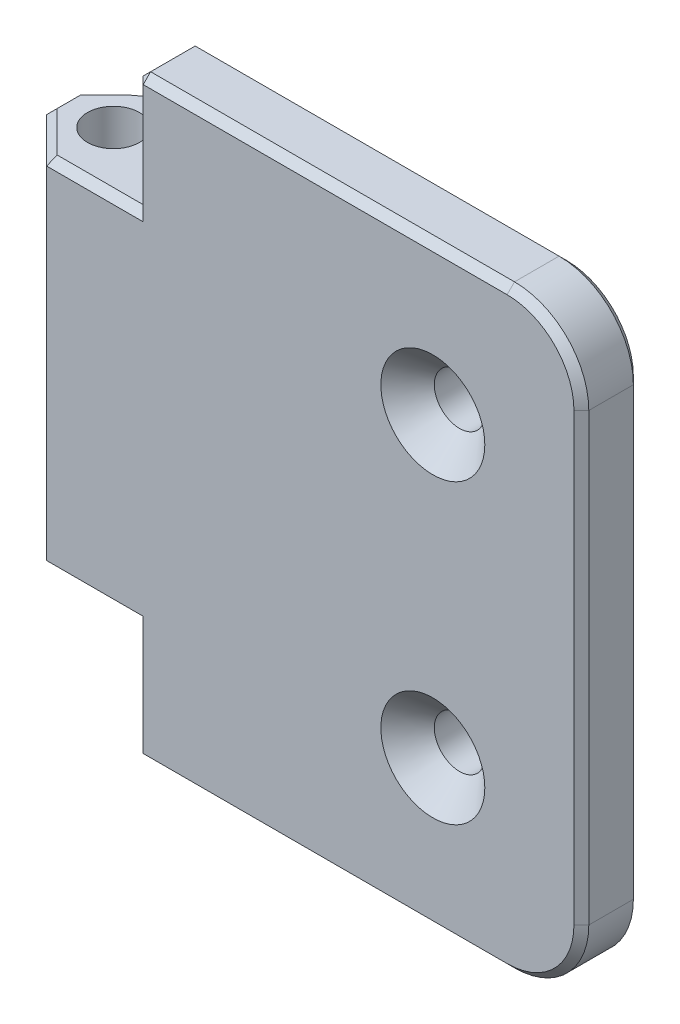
from build123d import *

# Parameters (mm, degrees)
SKIZZE1_W                                            = 39
SKIZZE1_H                                            = 40
AUFSATZ_LINEAR_AUSTRAGEN1_DEPTH                      = 8
SKIZZE2_W                                            = 30
SKIZZE2_H                                            = 4
SCHNITT_LINEAR_AUSTRAGEN1_DEPTH                      = 57.435804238
FORMSENKUNG_F_R_M3_SENKSCHRAUBE_MIT_INNE_D           = 3.4
FORMSENKUNG_F_R_M3_SENKSCHRAUBE_MIT_INNE_CSINK_D     = 7
FORMSENKUNG_F_R_M3_SENKSCHRAUBE_MIT_INNE_CSINK_ANGLE = 90
F_3_5_3_5_DURCHMESSER_BOHRUNG1_D                     = 3.5
VERRUNDUNG1_R                                        = 5
SKIZZE7_W                                            = 9
SKIZZE7_H                                            = 8
SCHNITT_LINEAR_AUSTRAGEN2_DEPTH                      = 57.435804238
FASE3_SIZE                                           = 3
VERRUNDUNG2_R                                        = 5
FASE1_SIZE                                           = 0.5
FASE2_SIZE                                           = 0.5


with BuildPart() as part:
    # Skizze1 → Aufsatz-Linear austragen1 (new body)
    with BuildSketch(Plane.XY):
        with Locations((-19.5, -20)):
            Rectangle(SKIZZE1_W, SKIZZE1_H)
    extrude(amount=-AUFSATZ_LINEAR_AUSTRAGEN1_DEPTH)

    # Skizze2 → Schnitt-Linear austragen1 (cut, through all)
    with BuildSketch(Plane(origin=(0, 0, 0), x_dir=(1, 0, 0), z_dir=(0, 1, 0))):
        with Locations((-15, 6)):
            Rectangle(SKIZZE2_W, SKIZZE2_H)
    extrude(amount=-SCHNITT_LINEAR_AUSTRAGEN1_DEPTH, mode=Mode.SUBTRACT)

    # Formsenkung f_r M3 Senkschraube mit Inne (through all)
    with Locations(Plane.XY):
        with Locations((-10, -10), (-10, -30)):
            CounterSinkHole(FORMSENKUNG_F_R_M3_SENKSCHRAUBE_MIT_INNE_D / 2, FORMSENKUNG_F_R_M3_SENKSCHRAUBE_MIT_INNE_CSINK_D / 2, counter_sink_angle=FORMSENKUNG_F_R_M3_SENKSCHRAUBE_MIT_INNE_CSINK_ANGLE)

    # 3.5 _3.5_ Durchmesser Bohrung1 (through all)
    with Locations(Plane(origin=(0, 0, 0), x_dir=(1, 0, 0), z_dir=(0, 1, 0))):
        with Locations((-35.5, 4)):
            Hole(F_3_5_3_5_DURCHMESSER_BOHRUNG1_D / 2)

    # Verrundung1
    verrundung1_edges = [part.edges().sort_by_distance(p)[0] for p in [
        (0, 0, -2),
        (0, -40, -2),
    ]]
    fillet(verrundung1_edges, radius=VERRUNDUNG1_R)

    # Skizze7 → Schnitt-Linear austragen2 (cut, through all)
    with BuildSketch(Plane.XY):
        with Locations((-34.5, -4)):
            Rectangle(SKIZZE7_W, SKIZZE7_H)
        with Locations((-34.5, -36)):
            Rectangle(SKIZZE7_W, SKIZZE7_H)
    extrude(amount=-SCHNITT_LINEAR_AUSTRAGEN2_DEPTH, mode=Mode.SUBTRACT)

    # Fase3
    fase3_edges = [part.edges().sort_by_distance(p)[0] for p in [
        (-39, -20, 0),
        (-39, -20, -8),
    ]]
    chamfer(fase3_edges, length=FASE3_SIZE)

    # Verrundung2
    verrundung2_edges = [part.edges().sort_by_distance(p)[0] for p in [
        (-36, -20, -8),
    ]]
    fillet(verrundung2_edges, radius=VERRUNDUNG2_R)

    # Fase1
    fase1_edges = [part.edges().sort_by_distance(p)[0] for p in [
        (-33, -8, 0),
        (-37.5, -8, -1.5),
        (-31.964466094, -8, -8),
        (-38.232233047, -8, -5.767766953),
        (-35.84234935, -8, -7.619397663),
        (-35.84234935, -32, -7.619397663),
        (-17.5, -40, -4),
        (-30, -36, -4),
        (-17.5, 0, -4),
        (0, -20, 0),
        (-17.5, 0, 0),
        (-1.464466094, -1.464466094, 0),
        (-1.464466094, -38.535533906, 0),
        (0, -20, -4),
        (-1.464466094, -1.464466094, -4),
        (-1.464466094, -38.535533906, -4),
        (-30, -4, -4),
        (-30, -20, -8),
        (-17.5, -40, 0),
        (-30, 0, -2),
        (-30, -4, 0),
        (-31.964466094, -32, -8),
        (-30, -40, -2),
        (-30, -36, 0),
        (-33, -32, 0),
        (-39, -8, -4),
        (-39, -32, -4),
        (-37.5, -32, -1.5),
        (-38.232233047, -32, -5.767766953),
    ]]
    chamfer(fase1_edges, length=FASE1_SIZE)

    # Fase2
    fase2_edges = [part.edges().sort_by_distance(p)[0] for p in [
        (-30, -32, -5.75),
        (-30, -8, -5.75),
    ]]
    chamfer(fase2_edges, length=FASE2_SIZE)


solid = part.part
